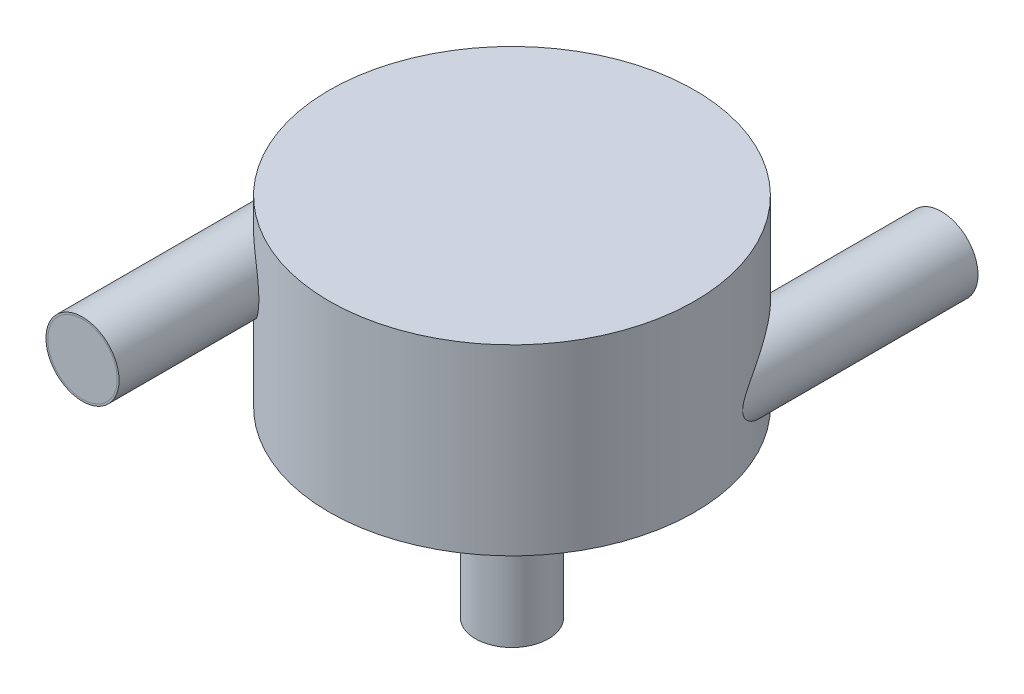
from build123d import *

# Parameters (mm, degrees)
SKETCH1_R                = 1000
BOSS_EXTRUDE1_DEPTH      = 1000
BOSS_EXTRUDE2_REACH      = 2961.73
BOSS_EXTRUDE2_END_RADIUS = 1000
SKETCH2_R                = 200
BOSS_EXTRUDE3_REACH      = 3500.571
BOSS_EXTRUDE3_END_RADIUS = 1000
SKETCH3_R                = 200
SKETCH5_R                = 200
BOSS_EXTRUDE4_DEPTH      = 1000
SHELL1_T                 = -10
SKETCH6_R                = 190
LID_1_DEPTH              = 50
SKETCH7_R                = 190
LID_2_DEPTH              = 50
SKETCH8_R                = 190
LID_3_DEPTH              = 50


with BuildPart() as part:
    # Sketch1 → Boss-Extrude1 (new body)
    with BuildSketch(Plane(origin=(0, 0, 0), x_dir=(1, 0, 0), z_dir=(0, 1, 0))):
        with Locations(Location((0, 0, 0), (0, 0, 270))):
            Circle(SKETCH1_R)
    extrude(amount=BOSS_EXTRUDE1_DEPTH)

    # Boss-Extrude2: up to this cylinder (the profile starts outside it)
    boss_extrude2_end = Plane(origin=(0, 650, 0), z_dir=(0, -1, 0)) * Cylinder(BOSS_EXTRUDE2_END_RADIUS, 7924.46, mode=Mode.PRIVATE)
    # Sketch2 → Boss-Extrude2 (add, up to the surface)
    with BuildSketch(Plane.XY.offset(1600), mode=Mode.PRIVATE) as boss_extrude2_sk1:
        with Locations((-750, 650)):
            Circle(SKETCH2_R)
    boss_extrude2_tool1 = extrude(boss_extrude2_sk1.sketch, amount=-BOSS_EXTRUDE2_REACH, mode=Mode.PRIVATE) - boss_extrude2_end
    add(boss_extrude2_tool1.solids().sort_by_distance((-750, 650, 1600))[0])

    # Boss-Extrude3: up to this cylinder (the profile starts outside it)
    boss_extrude3_end = Plane(origin=(0, 300, 0), z_dir=(0, -1, 0)) * Cylinder(BOSS_EXTRUDE3_END_RADIUS, 9002.142, mode=Mode.PRIVATE)
    # Sketch3 → Boss-Extrude3 (add, up to the surface)
    with BuildSketch(Plane.XY.offset(-1600), mode=Mode.PRIVATE) as boss_extrude3_sk1:
        with Locations(Location((750, 300, 0), (0, 0, 180))):
            Circle(SKETCH3_R)
    boss_extrude3_tool1 = extrude(boss_extrude3_sk1.sketch, amount=BOSS_EXTRUDE3_REACH, mode=Mode.PRIVATE) - boss_extrude3_end
    add(boss_extrude3_tool1.solids().sort_by_distance((750, 300, -1600))[0])

    # Sketch5 → Boss-Extrude4 (add)
    with BuildSketch(Plane.XZ):
        with Locations(Location((0, 0, 0), (0, 0, 270))):
            Circle(SKETCH5_R)
    extrude(amount=BOSS_EXTRUDE4_DEPTH)

    # Shell1
    shell1_openings = [part.faces().sort_by_distance(p)[0] for p in [
        (750, 300, -1600),
        (0, -1000, 0),
        (-750, 650, 1600),
    ]]
    offset(amount=SHELL1_T, openings=shell1_openings, kind=Kind.INTERSECTION)


with BuildPart() as body_2:
    # Sketch6 → Lid 1 (new body)
    with BuildSketch(Plane.XY.offset(1600)):
        with Locations((-750, 650)):
            Circle(SKETCH6_R)
    extrude(amount=-LID_1_DEPTH)


with BuildPart() as body_3:
    # Sketch7 → Lid 2 (new body)
    with BuildSketch(Plane(origin=(0, 0, -1600), x_dir=(-1, 0, 0), z_dir=(0, 0, -1))):
        with Locations((-750, 300)):
            Circle(SKETCH7_R)
    extrude(amount=-LID_2_DEPTH)


with BuildPart() as body_4:
    # Sketch8 → Lid 3 (new body)
    with BuildSketch(Plane.XZ.offset(1000)):
        with Locations(Location((0, 0, 0), (0, 0, 270))):
            Circle(SKETCH8_R)
    extrude(amount=-LID_3_DEPTH)


solid = Compound([part.part, body_2.part, body_3.part, body_4.part])
